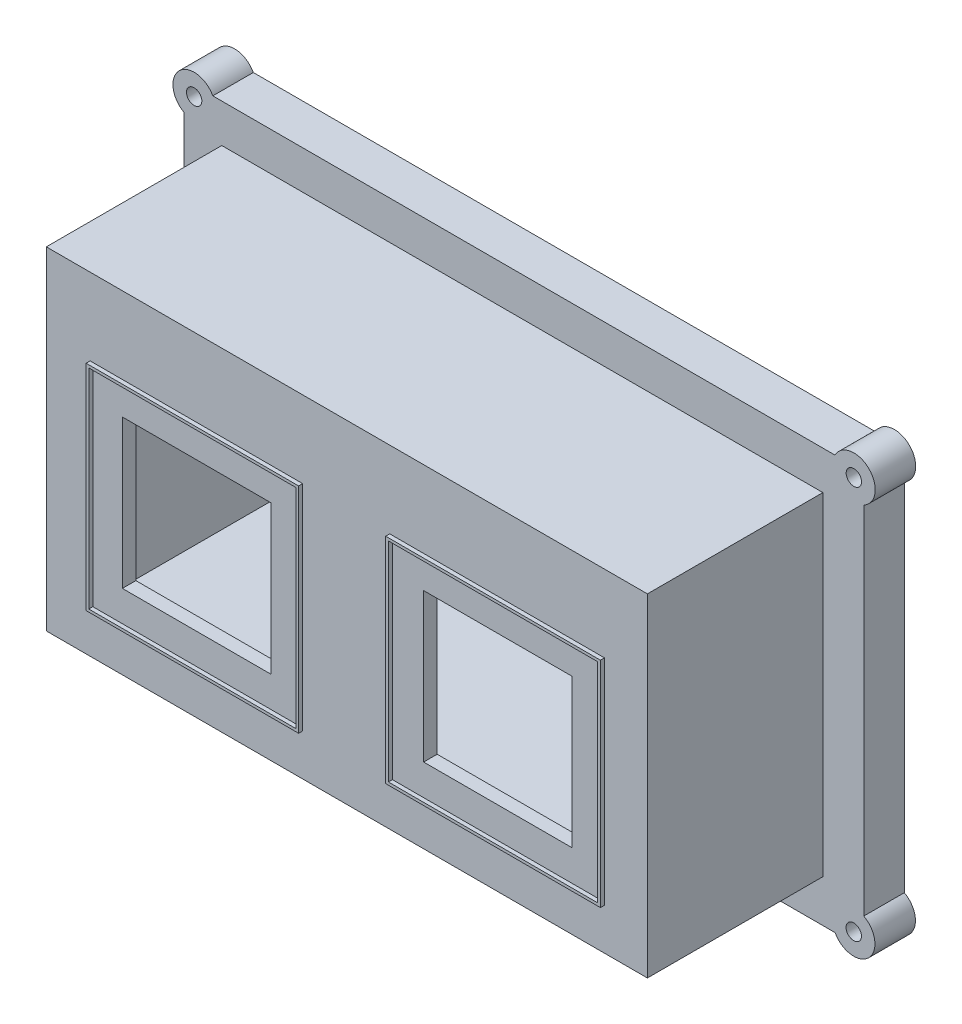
from build123d import *

# Parameters (mm, degrees)
SKETCH15_W          = 113.106538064
SKETCH15_H          = 62.597560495
SKETCH15_W_2        = 27.94
SKETCH15_H_2        = 27.94
BOSS_EXTRUDE5_DEPTH = 2.54
SKETCH16_W          = 40.001253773
SKETCH16_H          = 40.309263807
SKETCH16_W_2        = 38.985253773
SKETCH16_H_2        = 39.293263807
SKETCH16_W_3        = 40.41598831
SKETCH16_H_3        = 40.319300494
SKETCH16_W_4        = 39.39998831
BOSS_EXTRUDE6_DEPTH = 3.302
SKETCH17_W          = 113.106538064
SKETCH17_H          = 62.597560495
SKETCH17_W_2        = 108.026538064
SKETCH17_H_2        = 57.517560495
BOSS_EXTRUDE7_DEPTH = 38.1
BOSS_EXTRUDE8_START = -38.1
SKETCH18_W          = 127.903377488
SKETCH18_H          = 77.810242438
SKETCH18_W_2        = 113.106538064
SKETCH18_H_2        = 62.597560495
BOSS_EXTRUDE8_DEPTH = 7.62
SKETCH28_R          = 3.9878
SKETCH28_R_2        = 3.987799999
SKETCH28_R_3        = 4.015199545
SKETCH28_R_4        = 3.987799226
BOSS_EXTRUDE9_DEPTH = 7.62
SKETCH29_R          = 1.4478
CUT_EXTRUDE1_DEPTH  = 7.62


with BuildPart() as part:
    # Sketch15 → Boss-Extrude5 (new body)
    with BuildSketch(Plane.XY):
        with Locations((31.74809217, 12.622069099)):
            Rectangle(SKETCH15_W, SKETCH15_H)
        with Locations((3.473481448, 9.38082659)):
            Rectangle(SKETCH15_W_2, SKETCH15_H_2, mode=Mode.SUBTRACT)
        with Locations((60.169183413, 9.434612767)):
            Rectangle(SKETCH15_W_2, SKETCH15_H_2, mode=Mode.SUBTRACT)
    extrude(amount=BOSS_EXTRUDE5_DEPTH)

    # Sketch16 → Boss-Extrude6 (add)
    # profile 1 of 2: a face of its own
    with BuildSketch(Plane.XY):
        with Locations((3.440498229, 9.303440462)):
            Rectangle(SKETCH16_W, SKETCH16_H)
        with Locations((3.440498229, 9.303440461)):
            Rectangle(SKETCH16_W_2, SKETCH16_H_2, mode=Mode.SUBTRACT)
    # profile 2 of 2: a face of its own
    with BuildSketch(Plane.XY):
        with Locations((60.019875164, 9.297584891)):
            Rectangle(SKETCH16_W_3, SKETCH16_H_3)
        with Locations((60.019875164, 9.303440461)):
            Rectangle(SKETCH16_W_4, SKETCH16_H_2, mode=Mode.SUBTRACT)
    extrude(amount=BOSS_EXTRUDE6_DEPTH)

    # Sketch17 → Boss-Extrude7 (add)
    with BuildSketch(Plane.XY):
        with Locations((31.74809217, 12.622069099)):
            Rectangle(SKETCH17_W, SKETCH17_H)
        with Locations((31.74809217, 12.6220691)):
            Rectangle(SKETCH17_W_2, SKETCH17_H_2, mode=Mode.SUBTRACT)
    extrude(amount=-BOSS_EXTRUDE7_DEPTH)

    # Sketch18 → Boss-Extrude8 (add)
    with BuildSketch(Plane.XY.offset(BOSS_EXTRUDE8_START)):
        with Locations((32.053014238, 12.261393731)):
            Rectangle(SKETCH18_W, SKETCH18_H)
        with Locations((31.74809217, 12.622069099)):
            Rectangle(SKETCH18_W_2, SKETCH18_H_2, mode=Mode.SUBTRACT)
    extrude(amount=BOSS_EXTRUDE8_DEPTH)

    # Cut-Sweep2: sweep along a path in Sketch23
    with BuildLine(Plane.XY.offset(-38.1)) as cut_sweep2_path:
        Line((86.05178227, 46.801594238), (-21.945753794, 46.801594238))
        ThreePointArc((-21.945753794, 46.801594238), (-25.897066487, 45.164906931), (-27.533753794, 41.213594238))
        Line((-27.533753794, 41.213594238), (-27.533753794, -16.690806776))
        ThreePointArc((-27.533753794, -16.690806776), (-25.897066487, -20.642119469), (-21.945753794, -22.278806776))
        Line((-21.945753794, -22.278806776), (86.05178227, -22.278806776))
        ThreePointArc((86.05178227, -22.278806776), (90.003094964, -20.642119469), (91.63978227, -16.690806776))
        Line((91.63978227, -16.690806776), (91.63978227, 41.213594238))
        ThreePointArc((91.63978227, 41.213594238), (90.003094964, 45.164906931), (86.05178227, 46.801594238))
    # Sketch25 → Cut-Sweep2 (sweep, cut)
    with BuildSketch(Plane.XZ.offset(-23.35082659)):
        with BuildLine():
            Line((-29.358674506, -38.1), (-25.802674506, -38.1))
            Line((-25.802674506, -38.1), (-25.802674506, -36.449))
            ThreePointArc((-25.802674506, -36.449), (-25.877069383, -36.269394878), (-26.056674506, -36.195))
            Line((-26.056674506, -36.195), (-29.104674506, -36.195))
            ThreePointArc((-29.104674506, -36.195), (-29.284279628, -36.269394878), (-29.358674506, -36.449))
            Line((-29.358674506, -36.449), (-29.358674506, -38.1))
        make_face()
    sweep(path=cut_sweep2_path.line, mode=Mode.SUBTRACT)

    # Sketch28 → Boss-Extrude9 (add)
    with BuildSketch(Plane(origin=(0, 0, -38.1), x_dir=(-1, 0, 0), z_dir=(0, 0, -1))):
        with Locations((30.007280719, -24.752333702)):
            Circle(SKETCH28_R)
        with Locations((30.007244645, 49.275157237)):
            Circle(SKETCH28_R_2)
        with Locations((-94.132735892, 49.294443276)):
            Circle(SKETCH28_R_3)
        with Locations((-94.1119821, -24.75365908)):
            Circle(SKETCH28_R_4)
    extrude(amount=-BOSS_EXTRUDE9_DEPTH)

    # Sketch29 → Cut-Extrude1 (cut)
    with BuildSketch(Plane(origin=(0, 0, -38.1), x_dir=(-1, 0, 0), z_dir=(0, 0, -1))):
        with Locations((-94.1119821, -24.75365908)):
            Circle(SKETCH29_R)
        with Locations((-94.132735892, 49.294443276)):
            Circle(SKETCH29_R)
        with Locations((30.007414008, 49.294443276)):
            Circle(SKETCH29_R)
        with Locations((30.007414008, -24.75365908)):
            Circle(SKETCH29_R)
    extrude(amount=-CUT_EXTRUDE1_DEPTH, mode=Mode.SUBTRACT)


solid = part.part
